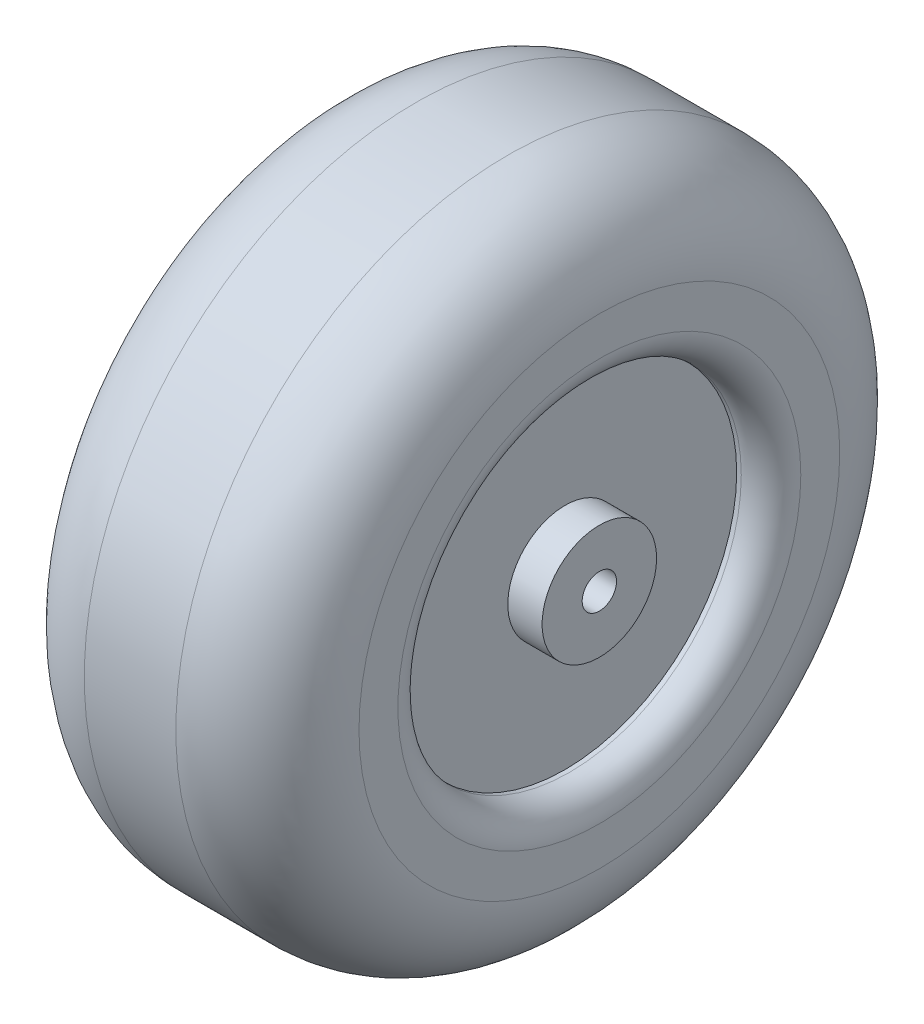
ISO-10303-21;
HEADER;
FILE_DESCRIPTION(('STEP AP214'),'2;1');
FILE_NAME('part.step','',(''),(''),'','','');
FILE_SCHEMA(('AUTOMOTIVE_DESIGN { 1 0 10303 214 1 1 1 1 }'));
ENDSEC;
DATA;
#1=APPLICATION_CONTEXT('core data for automotive mechanical design processes');
#2=APPLICATION_PROTOCOL_DEFINITION('international standard','automotive_design',2000,#1);
#3=PRODUCT_CONTEXT('',#1,'mechanical');
#4=PRODUCT('Part','Part','',(#3));
#5=PRODUCT_RELATED_PRODUCT_CATEGORY('part','',(#4));
#6=PRODUCT_DEFINITION_FORMATION('','',#4);
#7=PRODUCT_DEFINITION_CONTEXT('part definition',#1,'design');
#8=PRODUCT_DEFINITION('design','',#6,#7);
#9=PRODUCT_DEFINITION_SHAPE('','',#8);
#10=(LENGTH_UNIT() NAMED_UNIT(*) SI_UNIT(.MILLI.,.METRE.));
#11=(NAMED_UNIT(*) PLANE_ANGLE_UNIT() SI_UNIT($,.RADIAN.));
#12=(NAMED_UNIT(*) SI_UNIT($,.STERADIAN.) SOLID_ANGLE_UNIT());
#13=UNCERTAINTY_MEASURE_WITH_UNIT(LENGTH_MEASURE(1.E-05),#10,'distance_accuracy_value','');
#14=(GEOMETRIC_REPRESENTATION_CONTEXT(3) GLOBAL_UNCERTAINTY_ASSIGNED_CONTEXT((#13)) GLOBAL_UNIT_ASSIGNED_CONTEXT((#10,
#11,#12)) REPRESENTATION_CONTEXT('',''));
#15=CARTESIAN_POINT('',(0.,0.,0.));
#16=DIRECTION('',(0.,0.,1.));
#17=DIRECTION('',(1.,0.,0.));
#18=AXIS2_PLACEMENT_3D('',#15,#16,#17);
#19=CARTESIAN_POINT('',(0.,0.,0.));
#20=DIRECTION('',(1.,0.,0.));
#21=DIRECTION('',(0.,0.,-1.));
#22=AXIS2_PLACEMENT_3D('',#19,#20,#21);
#23=PLANE('',#22);
#24=CARTESIAN_POINT('',(0.,0.,0.));
#25=DIRECTION('',(1.,0.,0.));
#26=DIRECTION('',(0.,0.,-1.));
#27=AXIS2_PLACEMENT_3D('',#24,#25,#26);
#28=CIRCLE('',#27,0.75);
#29=CARTESIAN_POINT('',(0.,0.,-0.75));
#30=VERTEX_POINT('',#29);
#31=EDGE_CURVE('E65',#30,#30,#28,.T.);
#32=ORIENTED_EDGE('',*,*,#31,.T.);
#33=EDGE_LOOP('',(#32));
#34=FACE_BOUND('',#33,.T.);
#35=CARTESIAN_POINT('',(0.,0.,0.));
#36=DIRECTION('',(-1.,0.,0.));
#37=DIRECTION('',(0.,0.,1.));
#38=AXIS2_PLACEMENT_3D('',#35,#36,#37);
#39=CIRCLE('',#38,2.5);
#40=CARTESIAN_POINT('',(0.,0.,2.5));
#41=VERTEX_POINT('',#40);
#42=EDGE_CURVE('E83',#41,#41,#39,.T.);
#43=ORIENTED_EDGE('',*,*,#42,.T.);
#44=EDGE_LOOP('',(#43));
#45=FACE_BOUND('',#44,.T.);
#46=ADVANCED_FACE('F32',(#34,#45),#23,.F.);
#47=CARTESIAN_POINT('',(12.,0.,0.));
#48=DIRECTION('',(1.,0.,0.));
#49=DIRECTION('',(0.,0.,-1.));
#50=AXIS2_PLACEMENT_3D('',#47,#48,#49);
#51=PLANE('',#50);
#52=CARTESIAN_POINT('',(12.,0.,0.));
#53=DIRECTION('',(1.,0.,0.));
#54=DIRECTION('',(0.,0.,-1.));
#55=AXIS2_PLACEMENT_3D('',#52,#53,#54);
#56=CIRCLE('',#55,0.75);
#57=CARTESIAN_POINT('',(12.,0.,-0.75));
#58=VERTEX_POINT('',#57);
#59=EDGE_CURVE('E64',#58,#58,#56,.T.);
#60=ORIENTED_EDGE('',*,*,#59,.F.);
#61=EDGE_LOOP('',(#60));
#62=FACE_BOUND('',#61,.T.);
#63=CARTESIAN_POINT('',(12.,0.,0.));
#64=DIRECTION('',(1.,0.,0.));
#65=DIRECTION('',(0.,0.,-1.));
#66=AXIS2_PLACEMENT_3D('',#63,#64,#65);
#67=CIRCLE('',#66,2.5);
#68=CARTESIAN_POINT('',(12.,0.,-2.5));
#69=VERTEX_POINT('',#68);
#70=EDGE_CURVE('E74',#69,#69,#67,.T.);
#71=ORIENTED_EDGE('',*,*,#70,.T.);
#72=EDGE_LOOP('',(#71));
#73=FACE_BOUND('',#72,.T.);
#74=ADVANCED_FACE('F109',(#62,#73),#51,.T.);
#75=CARTESIAN_POINT('',(12.,0.,0.));
#76=DIRECTION('',(1.,0.,0.));
#77=DIRECTION('',(0.,0.,-1.));
#78=AXIS2_PLACEMENT_3D('',#75,#76,#77);
#79=CIRCLE('',#78,8.8);
#80=CARTESIAN_POINT('',(12.,0.,-8.8));
#81=VERTEX_POINT('',#80);
#82=EDGE_CURVE('E43',#81,#81,#79,.F.);
#83=ORIENTED_EDGE('',*,*,#82,.T.);
#84=EDGE_LOOP('',(#83));
#85=FACE_BOUND('',#84,.T.);
#86=CARTESIAN_POINT('',(12.,0.,0.));
#87=DIRECTION('',(1.,0.,0.));
#88=DIRECTION('',(0.,0.,-1.));
#89=AXIS2_PLACEMENT_3D('',#86,#87,#88);
#90=CIRCLE('',#89,10.5);
#91=CARTESIAN_POINT('',(12.,0.,-10.5));
#92=VERTEX_POINT('',#91);
#93=EDGE_CURVE('E61',#92,#92,#90,.T.);
#94=ORIENTED_EDGE('',*,*,#93,.T.);
#95=EDGE_LOOP('',(#94));
#96=FACE_BOUND('',#95,.T.);
#97=ADVANCED_FACE('F116',(#85,#96),#51,.T.);
#98=CARTESIAN_POINT('',(0.,0.,0.));
#99=DIRECTION('',(1.,0.,0.));
#100=DIRECTION('',(0.,0.,-1.));
#101=AXIS2_PLACEMENT_3D('',#98,#99,#100);
#102=CIRCLE('',#101,8.8);
#103=CARTESIAN_POINT('',(0.,0.,-8.8));
#104=VERTEX_POINT('',#103);
#105=EDGE_CURVE('E10',#104,#104,#102,.T.);
#106=ORIENTED_EDGE('',*,*,#105,.T.);
#107=EDGE_LOOP('',(#106));
#108=FACE_BOUND('',#107,.T.);
#109=CARTESIAN_POINT('',(0.,0.,0.));
#110=DIRECTION('',(1.,0.,0.));
#111=DIRECTION('',(0.,0.,-1.));
#112=AXIS2_PLACEMENT_3D('',#109,#110,#111);
#113=CIRCLE('',#112,10.5);
#114=CARTESIAN_POINT('',(0.,0.,-10.5));
#115=VERTEX_POINT('',#114);
#116=EDGE_CURVE('E52',#115,#115,#113,.F.);
#117=ORIENTED_EDGE('',*,*,#116,.T.);
#118=EDGE_LOOP('',(#117));
#119=FACE_BOUND('',#118,.T.);
#120=ADVANCED_FACE('F112',(#108,#119),#23,.F.);
#121=CARTESIAN_POINT('',(12.,0.,0.));
#122=DIRECTION('',(-1.,0.,0.));
#123=DIRECTION('',(0.,0.,1.));
#124=AXIS2_PLACEMENT_3D('',#121,#122,#123);
#125=CYLINDRICAL_SURFACE('',#124,14.5);
#126=CARTESIAN_POINT('',(8.,0.,0.));
#127=DIRECTION('',(1.,0.,0.));
#128=DIRECTION('',(0.,0.,-1.));
#129=AXIS2_PLACEMENT_3D('',#126,#127,#128);
#130=CIRCLE('',#129,14.5);
#131=CARTESIAN_POINT('',(8.,0.,-14.5));
#132=VERTEX_POINT('',#131);
#133=EDGE_CURVE('E55',#132,#132,#130,.F.);
#134=ORIENTED_EDGE('',*,*,#133,.T.);
#135=EDGE_LOOP('',(#134));
#136=FACE_BOUND('',#135,.T.);
#137=CARTESIAN_POINT('',(4.,0.,0.));
#138=DIRECTION('',(1.,0.,0.));
#139=DIRECTION('',(0.,0.,-1.));
#140=AXIS2_PLACEMENT_3D('',#137,#138,#139);
#141=CIRCLE('',#140,14.5);
#142=CARTESIAN_POINT('',(4.,0.,-14.5));
#143=VERTEX_POINT('',#142);
#144=EDGE_CURVE('E58',#143,#143,#141,.T.);
#145=ORIENTED_EDGE('',*,*,#144,.T.);
#146=EDGE_LOOP('',(#145));
#147=FACE_BOUND('',#146,.T.);
#148=ADVANCED_FACE('F122',(#136,#147),#125,.T.);
#149=CARTESIAN_POINT('',(12.,0.,0.));
#150=DIRECTION('',(-1.,0.,0.));
#151=DIRECTION('',(0.,0.,1.));
#152=AXIS2_PLACEMENT_3D('',#149,#150,#151);
#153=CYLINDRICAL_SURFACE('',#152,0.75);
#154=ORIENTED_EDGE('',*,*,#59,.T.);
#155=EDGE_LOOP('',(#154));
#156=FACE_BOUND('',#155,.T.);
#157=ORIENTED_EDGE('',*,*,#31,.F.);
#158=EDGE_LOOP('',(#157));
#159=FACE_BOUND('',#158,.T.);
#160=ADVANCED_FACE('F127',(#156,#159),#153,.F.);
#161=CARTESIAN_POINT('',(10.5,0.,0.));
#162=DIRECTION('',(1.,0.,0.));
#163=DIRECTION('',(0.,0.,-1.));
#164=AXIS2_PLACEMENT_3D('',#161,#162,#163);
#165=CYLINDRICAL_SURFACE('',#164,7.5);
#166=CARTESIAN_POINT('',(10.7,0.,0.));
#167=DIRECTION('',(1.,0.,0.));
#168=DIRECTION('',(0.,0.,-1.));
#169=AXIS2_PLACEMENT_3D('',#166,#167,#168);
#170=CIRCLE('',#169,7.5);
#171=CARTESIAN_POINT('',(10.7,0.,-7.5));
#172=VERTEX_POINT('',#171);
#173=EDGE_CURVE('E47',#172,#172,#170,.T.);
#174=ORIENTED_EDGE('',*,*,#173,.T.);
#175=EDGE_LOOP('',(#174));
#176=FACE_BOUND('',#175,.T.);
#177=CARTESIAN_POINT('',(10.5,0.,0.));
#178=DIRECTION('',(1.,0.,0.));
#179=DIRECTION('',(0.,0.,-1.));
#180=AXIS2_PLACEMENT_3D('',#177,#178,#179);
#181=CIRCLE('',#180,7.5);
#182=CARTESIAN_POINT('',(10.5,0.,-7.5));
#183=VERTEX_POINT('',#182);
#184=EDGE_CURVE('E68',#183,#183,#181,.T.);
#185=ORIENTED_EDGE('',*,*,#184,.F.);
#186=EDGE_LOOP('',(#185));
#187=FACE_BOUND('',#186,.T.);
#188=ADVANCED_FACE('F188',(#176,#187),#165,.F.);
#189=CARTESIAN_POINT('',(10.5,0.,0.));
#190=DIRECTION('',(1.,0.,0.));
#191=DIRECTION('',(0.,0.,-1.));
#192=AXIS2_PLACEMENT_3D('',#189,#190,#191);
#193=PLANE('',#192);
#194=CARTESIAN_POINT('',(10.5,0.,0.));
#195=DIRECTION('',(1.,0.,0.));
#196=DIRECTION('',(0.,0.,-1.));
#197=AXIS2_PLACEMENT_3D('',#194,#195,#196);
#198=CIRCLE('',#197,2.5);
#199=CARTESIAN_POINT('',(10.5,0.,-2.5));
#200=VERTEX_POINT('',#199);
#201=EDGE_CURVE('E73',#200,#200,#198,.T.);
#202=ORIENTED_EDGE('',*,*,#201,.F.);
#203=EDGE_LOOP('',(#202));
#204=FACE_BOUND('',#203,.T.);
#205=ORIENTED_EDGE('',*,*,#184,.T.);
#206=EDGE_LOOP('',(#205));
#207=FACE_BOUND('',#206,.T.);
#208=ADVANCED_FACE('F105',(#204,#207),#193,.T.);
#209=CARTESIAN_POINT('',(10.5,0.,0.));
#210=DIRECTION('',(1.,0.,0.));
#211=DIRECTION('',(0.,0.,-1.));
#212=AXIS2_PLACEMENT_3D('',#209,#210,#211);
#213=CYLINDRICAL_SURFACE('',#212,2.5);
#214=ORIENTED_EDGE('',*,*,#201,.T.);
#215=EDGE_LOOP('',(#214));
#216=FACE_BOUND('',#215,.T.);
#217=ORIENTED_EDGE('',*,*,#70,.F.);
#218=EDGE_LOOP('',(#217));
#219=FACE_BOUND('',#218,.T.);
#220=ADVANCED_FACE('F100',(#216,#219),#213,.T.);
#221=CARTESIAN_POINT('',(1.5,0.,0.));
#222=DIRECTION('',(-1.,0.,0.));
#223=DIRECTION('',(0.,0.,1.));
#224=AXIS2_PLACEMENT_3D('',#221,#222,#223);
#225=CYLINDRICAL_SURFACE('',#224,7.5);
#226=CARTESIAN_POINT('',(1.3,0.,0.));
#227=DIRECTION('',(1.,0.,0.));
#228=DIRECTION('',(0.,0.,-1.));
#229=AXIS2_PLACEMENT_3D('',#226,#227,#228);
#230=CIRCLE('',#229,7.5);
#231=CARTESIAN_POINT('',(1.3,0.,-7.5));
#232=VERTEX_POINT('',#231);
#233=EDGE_CURVE('E39',#232,#232,#230,.F.);
#234=ORIENTED_EDGE('',*,*,#233,.T.);
#235=EDGE_LOOP('',(#234));
#236=FACE_BOUND('',#235,.T.);
#237=CARTESIAN_POINT('',(1.5,0.,0.));
#238=DIRECTION('',(-1.,0.,0.));
#239=DIRECTION('',(0.,0.,1.));
#240=AXIS2_PLACEMENT_3D('',#237,#238,#239);
#241=CIRCLE('',#240,7.5);
#242=CARTESIAN_POINT('',(1.5,0.,7.5));
#243=VERTEX_POINT('',#242);
#244=EDGE_CURVE('E77',#243,#243,#241,.T.);
#245=ORIENTED_EDGE('',*,*,#244,.F.);
#246=EDGE_LOOP('',(#245));
#247=FACE_BOUND('',#246,.T.);
#248=ADVANCED_FACE('F95',(#236,#247),#225,.F.);
#249=CARTESIAN_POINT('',(1.5,0.,0.));
#250=DIRECTION('',(-1.,0.,0.));
#251=DIRECTION('',(0.,0.,1.));
#252=AXIS2_PLACEMENT_3D('',#249,#250,#251);
#253=PLANE('',#252);
#254=CARTESIAN_POINT('',(1.5,0.,0.));
#255=DIRECTION('',(-1.,0.,0.));
#256=DIRECTION('',(0.,0.,1.));
#257=AXIS2_PLACEMENT_3D('',#254,#255,#256);
#258=CIRCLE('',#257,2.5);
#259=CARTESIAN_POINT('',(1.5,0.,2.5));
#260=VERTEX_POINT('',#259);
#261=EDGE_CURVE('E82',#260,#260,#258,.T.);
#262=ORIENTED_EDGE('',*,*,#261,.F.);
#263=EDGE_LOOP('',(#262));
#264=FACE_BOUND('',#263,.T.);
#265=ORIENTED_EDGE('',*,*,#244,.T.);
#266=EDGE_LOOP('',(#265));
#267=FACE_BOUND('',#266,.T.);
#268=ADVANCED_FACE('F92',(#264,#267),#253,.T.);
#269=CARTESIAN_POINT('',(1.5,0.,0.));
#270=DIRECTION('',(-1.,0.,0.));
#271=DIRECTION('',(0.,0.,1.));
#272=AXIS2_PLACEMENT_3D('',#269,#270,#271);
#273=CYLINDRICAL_SURFACE('',#272,2.5);
#274=ORIENTED_EDGE('',*,*,#261,.T.);
#275=EDGE_LOOP('',(#274));
#276=FACE_BOUND('',#275,.T.);
#277=ORIENTED_EDGE('',*,*,#42,.F.);
#278=EDGE_LOOP('',(#277));
#279=FACE_BOUND('',#278,.T.);
#280=ADVANCED_FACE('F89',(#276,#279),#273,.T.);
#281=CARTESIAN_POINT('',(8.,0.,0.));
#282=DIRECTION('',(1.,0.,0.));
#283=DIRECTION('',(0.,0.,-1.));
#284=AXIS2_PLACEMENT_3D('',#281,#282,#283);
#285=TOROIDAL_SURFACE('',#284,10.5,4.);
#286=ORIENTED_EDGE('',*,*,#133,.F.);
#287=EDGE_LOOP('',(#286));
#288=FACE_BOUND('',#287,.T.);
#289=ORIENTED_EDGE('',*,*,#93,.F.);
#290=EDGE_LOOP('',(#289));
#291=FACE_BOUND('',#290,.T.);
#292=ADVANCED_FACE('F137',(#288,#291),#285,.T.);
#293=CARTESIAN_POINT('',(4.,0.,0.));
#294=DIRECTION('',(1.,0.,0.));
#295=DIRECTION('',(0.,0.,-1.));
#296=AXIS2_PLACEMENT_3D('',#293,#294,#295);
#297=TOROIDAL_SURFACE('',#296,10.5,4.);
#298=ORIENTED_EDGE('',*,*,#116,.F.);
#299=EDGE_LOOP('',(#298));
#300=FACE_BOUND('',#299,.T.);
#301=ORIENTED_EDGE('',*,*,#144,.F.);
#302=EDGE_LOOP('',(#301));
#303=FACE_BOUND('',#302,.T.);
#304=ADVANCED_FACE('F133',(#300,#303),#297,.T.);
#305=CARTESIAN_POINT('',(10.7,0.,0.));
#306=DIRECTION('',(1.,0.,0.));
#307=DIRECTION('',(0.,0.,-1.));
#308=AXIS2_PLACEMENT_3D('',#305,#306,#307);
#309=TOROIDAL_SURFACE('',#308,8.8,1.3);
#310=ORIENTED_EDGE('',*,*,#82,.F.);
#311=EDGE_LOOP('',(#310));
#312=FACE_BOUND('',#311,.T.);
#313=ORIENTED_EDGE('',*,*,#173,.F.);
#314=EDGE_LOOP('',(#313));
#315=FACE_BOUND('',#314,.T.);
#316=ADVANCED_FACE('F136',(#312,#315),#309,.T.);
#317=CARTESIAN_POINT('',(1.3,0.,0.));
#318=DIRECTION('',(1.,0.,0.));
#319=DIRECTION('',(0.,0.,-1.));
#320=AXIS2_PLACEMENT_3D('',#317,#318,#319);
#321=TOROIDAL_SURFACE('',#320,8.8,1.3);
#322=ORIENTED_EDGE('',*,*,#105,.F.);
#323=EDGE_LOOP('',(#322));
#324=FACE_BOUND('',#323,.T.);
#325=ORIENTED_EDGE('',*,*,#233,.F.);
#326=EDGE_LOOP('',(#325));
#327=FACE_BOUND('',#326,.T.);
#328=ADVANCED_FACE('F34',(#324,#327),#321,.T.);
#329=CLOSED_SHELL('',(#46,#74,#97,#120,#148,#160,#188,#208,#220,#248,#268,#280,#292,#304,#316,#328));
#330=MANIFOLD_SOLID_BREP('B2',#329);
#331=ADVANCED_BREP_SHAPE_REPRESENTATION('',(#18,#330),#14);
#332=SHAPE_DEFINITION_REPRESENTATION(#9,#331);
ENDSEC;
END-ISO-10303-21;
